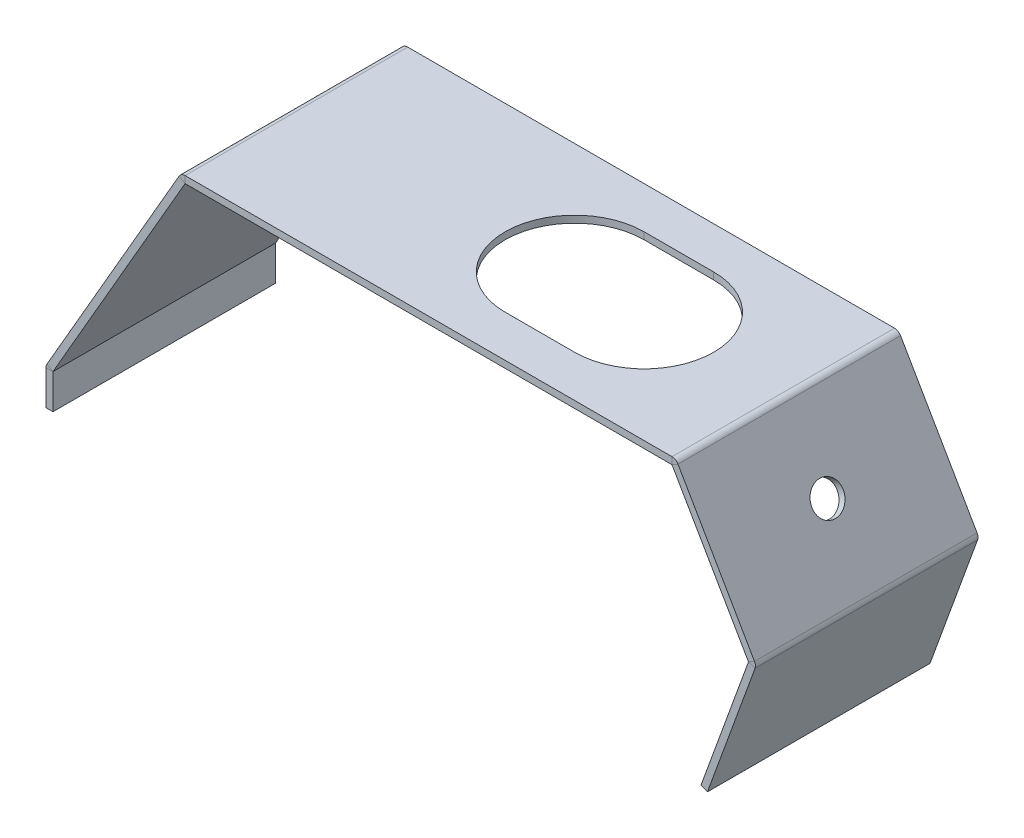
ISO-10303-21;
HEADER;
FILE_DESCRIPTION(('STEP AP214'),'2;1');
FILE_NAME('part.step','',(''),(''),'','','');
FILE_SCHEMA(('AUTOMOTIVE_DESIGN { 1 0 10303 214 1 1 1 1 }'));
ENDSEC;
DATA;
#1=APPLICATION_CONTEXT('core data for automotive mechanical design processes');
#2=APPLICATION_PROTOCOL_DEFINITION('international standard','automotive_design',2000,#1);
#3=PRODUCT_CONTEXT('',#1,'mechanical');
#4=PRODUCT('Part','Part','',(#3));
#5=PRODUCT_RELATED_PRODUCT_CATEGORY('part','',(#4));
#6=PRODUCT_DEFINITION_FORMATION('','',#4);
#7=PRODUCT_DEFINITION_CONTEXT('part definition',#1,'design');
#8=PRODUCT_DEFINITION('design','',#6,#7);
#9=PRODUCT_DEFINITION_SHAPE('','',#8);
#10=(LENGTH_UNIT() NAMED_UNIT(*) SI_UNIT(.MILLI.,.METRE.));
#11=(NAMED_UNIT(*) PLANE_ANGLE_UNIT() SI_UNIT($,.RADIAN.));
#12=(NAMED_UNIT(*) SI_UNIT($,.STERADIAN.) SOLID_ANGLE_UNIT());
#13=UNCERTAINTY_MEASURE_WITH_UNIT(LENGTH_MEASURE(1.E-05),#10,'distance_accuracy_value','');
#14=(GEOMETRIC_REPRESENTATION_CONTEXT(3) GLOBAL_UNCERTAINTY_ASSIGNED_CONTEXT((#13)) GLOBAL_UNIT_ASSIGNED_CONTEXT((#10,
#11,#12)) REPRESENTATION_CONTEXT('',''));
#15=CARTESIAN_POINT('',(0.,0.,0.));
#16=DIRECTION('',(0.,0.,1.));
#17=DIRECTION('',(1.,0.,0.));
#18=AXIS2_PLACEMENT_3D('',#15,#16,#17);
#19=CARTESIAN_POINT('',(20.6339455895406,-36.7390426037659,0.));
#20=DIRECTION('',(0.,0.,-1.));
#21=DIRECTION('',(-0.499999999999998,-0.86602540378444,0.));
#22=AXIS2_PLACEMENT_3D('',#19,#20,#21);
#23=PLANE('',#22);
#24=DIRECTION('',(0.499999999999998,0.86602540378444,0.));
#25=VECTOR('',#24,1.);
#26=CARTESIAN_POINT('',(20.6339455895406,-36.7390426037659,0.));
#27=LINE('',#26,#25);
#28=CARTESIAN_POINT('',(23.1339455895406,-32.4089155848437,0.));
#29=VERTEX_POINT('',#28);
#30=CARTESIAN_POINT('',(42.1338879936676,0.499949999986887,0.));
#31=VERTEX_POINT('',#30);
#32=EDGE_CURVE('E453',#29,#31,#27,.T.);
#33=ORIENTED_EDGE('',*,*,#32,.F.);
#34=DIRECTION('',(0.86602540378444,-0.499999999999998,0.));
#35=VECTOR('',#34,1.);
#36=CARTESIAN_POINT('',(23.1339455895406,-32.4089155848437,0.));
#37=LINE('',#36,#35);
#38=CARTESIAN_POINT('',(23.999970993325,-32.9089155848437,0.));
#39=VERTEX_POINT('',#38);
#40=EDGE_CURVE('E12',#29,#39,#37,.T.);
#41=ORIENTED_EDGE('',*,*,#40,.T.);
#42=DIRECTION('',(0.499999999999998,0.86602540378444,0.));
#43=VECTOR('',#42,1.);
#44=CARTESIAN_POINT('',(21.499970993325,-37.2390426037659,0.));
#45=LINE('',#44,#43);
#46=CARTESIAN_POINT('',(42.9999133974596,-5.00000000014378E-05,0.));
#47=VERTEX_POINT('',#46);
#48=EDGE_CURVE('E343',#39,#47,#45,.T.);
#49=ORIENTED_EDGE('',*,*,#48,.T.);
#50=DIRECTION('',(0.86602540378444,-0.499999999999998,0.));
#51=VECTOR('',#50,1.);
#52=CARTESIAN_POINT('',(42.1338879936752,0.499949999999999,0.));
#53=LINE('',#52,#51);
#54=EDGE_CURVE('E348',#31,#47,#53,.T.);
#55=ORIENTED_EDGE('',*,*,#54,.F.);
#56=EDGE_LOOP('',(#33,#41,#49,#55));
#57=FACE_BOUND('',#56,.T.);
#58=ADVANCED_FACE('F49',(#57),#23,.F.);
#59=CARTESIAN_POINT('',(20.6339455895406,-36.7390426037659,-32.));
#60=DIRECTION('',(0.,0.,1.));
#61=DIRECTION('',(0.499999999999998,0.86602540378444,0.));
#62=AXIS2_PLACEMENT_3D('',#59,#60,#61);
#63=PLANE('',#62);
#64=DIRECTION('',(-0.499999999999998,-0.86602540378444,0.));
#65=VECTOR('',#64,1.);
#66=CARTESIAN_POINT('',(21.499970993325,-37.2390426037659,-32.));
#67=LINE('',#66,#65);
#68=CARTESIAN_POINT('',(42.9999133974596,-5.00000000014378E-05,-32.));
#69=VERTEX_POINT('',#68);
#70=CARTESIAN_POINT('',(23.999970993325,-32.9089155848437,-32.));
#71=VERTEX_POINT('',#70);
#72=EDGE_CURVE('E344',#69,#71,#67,.T.);
#73=ORIENTED_EDGE('',*,*,#72,.T.);
#74=DIRECTION('',(-0.86602540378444,0.499999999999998,0.));
#75=VECTOR('',#74,1.);
#76=CARTESIAN_POINT('',(23.1339455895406,-32.4089155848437,-32.));
#77=LINE('',#76,#75);
#78=CARTESIAN_POINT('',(23.1339455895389,-32.4089155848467,-32.));
#79=VERTEX_POINT('',#78);
#80=EDGE_CURVE('E447',#71,#79,#77,.T.);
#81=ORIENTED_EDGE('',*,*,#80,.T.);
#82=DIRECTION('',(-0.499999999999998,-0.86602540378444,0.));
#83=VECTOR('',#82,1.);
#84=CARTESIAN_POINT('',(20.6339455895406,-36.7390426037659,-32.));
#85=LINE('',#84,#83);
#86=CARTESIAN_POINT('',(42.1338879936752,0.499949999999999,-32.));
#87=VERTEX_POINT('',#86);
#88=EDGE_CURVE('E52',#87,#79,#85,.T.);
#89=ORIENTED_EDGE('',*,*,#88,.F.);
#90=DIRECTION('',(-0.86602540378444,0.499999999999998,0.));
#91=VECTOR('',#90,1.);
#92=CARTESIAN_POINT('',(42.1338879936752,0.499949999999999,-32.));
#93=LINE('',#92,#91);
#94=EDGE_CURVE('E345',#69,#87,#93,.T.);
#95=ORIENTED_EDGE('',*,*,#94,.F.);
#96=EDGE_LOOP('',(#73,#81,#89,#95));
#97=FACE_BOUND('',#96,.T.);
#98=ADVANCED_FACE('F463',(#97),#63,.F.);
#99=CARTESIAN_POINT('',(20.6339455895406,-36.7390426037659,-32.));
#100=DIRECTION('',(0.86602540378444,-0.499999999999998,0.));
#101=DIRECTION('',(0.,0.,-1.));
#102=AXIS2_PLACEMENT_3D('',#99,#100,#101);
#103=PLANE('',#102);
#104=ORIENTED_EDGE('',*,*,#88,.T.);
#105=DIRECTION('',(0.,0.,1.));
#106=VECTOR('',#105,1.);
#107=CARTESIAN_POINT('',(23.1339455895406,-32.4089155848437,-32.));
#108=LINE('',#107,#106);
#109=EDGE_CURVE('E440',#79,#29,#108,.T.);
#110=ORIENTED_EDGE('',*,*,#109,.T.);
#111=ORIENTED_EDGE('',*,*,#32,.T.);
#112=DIRECTION('',(0.,0.,1.));
#113=VECTOR('',#112,1.);
#114=CARTESIAN_POINT('',(42.1338879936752,0.499949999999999,-32.));
#115=LINE('',#114,#113);
#116=EDGE_CURVE('E335',#87,#31,#115,.T.);
#117=ORIENTED_EDGE('',*,*,#116,.F.);
#118=EDGE_LOOP('',(#104,#110,#111,#117));
#119=FACE_BOUND('',#118,.T.);
#120=ADVANCED_FACE('F459',(#119),#103,.F.);
#121=CARTESIAN_POINT('',(56.5000290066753,97.8609203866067,-32.));
#122=DIRECTION('',(-0.86602540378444,-0.499999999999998,0.));
#123=DIRECTION('',(0.,0.,-1.));
#124=AXIS2_PLACEMENT_3D('',#121,#122,#123);
#125=PLANE('',#124);
#126=CARTESIAN_POINT('',(118.500029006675,-9.52622968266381,-16.));
#127=DIRECTION('',(0.86602540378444,0.499999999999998,0.));
#128=DIRECTION('',(0.,0.,1.));
#129=AXIS2_PLACEMENT_3D('',#126,#127,#128);
#130=CIRCLE('',#129,2.25000000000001);
#131=CARTESIAN_POINT('',(118.500029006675,-9.52622968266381,-13.75));
#132=VERTEX_POINT('',#131);
#133=EDGE_CURVE('E312',#132,#132,#130,.T.);
#134=ORIENTED_EDGE('',*,*,#133,.T.);
#135=EDGE_LOOP('',(#134));
#136=FACE_BOUND('',#135,.T.);
#137=DIRECTION('',(-0.499999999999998,0.86602540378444,0.));
#138=VECTOR('',#137,1.);
#139=CARTESIAN_POINT('',(56.5000290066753,97.8609203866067,-32.));
#140=LINE('',#139,#138);
#141=CARTESIAN_POINT('',(124.000029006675,-19.0525091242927,-32.));
#142=VERTEX_POINT('',#141);
#143=CARTESIAN_POINT('',(113.00008660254,-5.00000000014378E-05,-32.));
#144=VERTEX_POINT('',#143);
#145=EDGE_CURVE('E72',#142,#144,#140,.T.);
#146=ORIENTED_EDGE('',*,*,#145,.F.);
#147=DIRECTION('',(0.,0.,1.));
#148=VECTOR('',#147,1.);
#149=CARTESIAN_POINT('',(124.000029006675,-19.0525091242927,-32.));
#150=LINE('',#149,#148);
#151=CARTESIAN_POINT('',(124.000029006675,-19.0525091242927,0.));
#152=VERTEX_POINT('',#151);
#153=EDGE_CURVE('E435',#142,#152,#150,.T.);
#154=ORIENTED_EDGE('',*,*,#153,.T.);
#155=DIRECTION('',(0.499999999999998,-0.86602540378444,0.));
#156=VECTOR('',#155,1.);
#157=CARTESIAN_POINT('',(56.5000290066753,97.8609203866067,0.));
#158=LINE('',#157,#156);
#159=CARTESIAN_POINT('',(113.00008660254,-5.00000000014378E-05,0.));
#160=VERTEX_POINT('',#159);
#161=EDGE_CURVE('E315',#160,#152,#158,.T.);
#162=ORIENTED_EDGE('',*,*,#161,.F.);
#163=DIRECTION('',(0.,0.,1.));
#164=VECTOR('',#163,1.);
#165=CARTESIAN_POINT('',(113.00008660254,-5.00000000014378E-05,-32.));
#166=LINE('',#165,#164);
#167=EDGE_CURVE('E303',#144,#160,#166,.T.);
#168=ORIENTED_EDGE('',*,*,#167,.F.);
#169=EDGE_LOOP('',(#146,#154,#162,#168));
#170=FACE_BOUND('',#169,.T.);
#171=ADVANCED_FACE('F535',(#136,#170),#125,.T.);
#172=CARTESIAN_POINT('',(0.,0.,-32.));
#173=DIRECTION('',(0.,-1.,0.));
#174=DIRECTION('',(0.,0.,-1.));
#175=AXIS2_PLACEMENT_3D('',#172,#173,#174);
#176=PLANE('',#175);
#177=DIRECTION('',(1.,0.,0.));
#178=VECTOR('',#177,1.);
#179=CARTESIAN_POINT('',(93.,0.,-6.00000000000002));
#180=LINE('',#179,#178);
#181=CARTESIAN_POINT('',(83.,0.,-6.00000000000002));
#182=VERTEX_POINT('',#181);
#183=CARTESIAN_POINT('',(93.,0.,-6.00000000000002));
#184=VERTEX_POINT('',#183);
#185=EDGE_CURVE('E369',#182,#184,#180,.T.);
#186=ORIENTED_EDGE('',*,*,#185,.T.);
#187=CARTESIAN_POINT('',(93.,0.,-16.));
#188=DIRECTION('',(0.,1.,0.));
#189=DIRECTION('',(0.,0.,1.));
#190=AXIS2_PLACEMENT_3D('',#187,#188,#189);
#191=CIRCLE('',#190,9.99999999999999);
#192=CARTESIAN_POINT('',(93.,0.,-26.));
#193=VERTEX_POINT('',#192);
#194=EDGE_CURVE('E360',#184,#193,#191,.T.);
#195=ORIENTED_EDGE('',*,*,#194,.T.);
#196=DIRECTION('',(-1.,0.,0.));
#197=VECTOR('',#196,1.);
#198=CARTESIAN_POINT('',(93.,0.,-26.));
#199=LINE('',#198,#197);
#200=CARTESIAN_POINT('',(83.,0.,-26.));
#201=VERTEX_POINT('',#200);
#202=EDGE_CURVE('E379',#193,#201,#199,.T.);
#203=ORIENTED_EDGE('',*,*,#202,.T.);
#204=CARTESIAN_POINT('',(83.,0.,-16.));
#205=DIRECTION('',(0.,1.,0.));
#206=DIRECTION('',(0.,0.,1.));
#207=AXIS2_PLACEMENT_3D('',#204,#205,#206);
#208=CIRCLE('',#207,9.99999999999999);
#209=EDGE_CURVE('E382',#201,#182,#208,.T.);
#210=ORIENTED_EDGE('',*,*,#209,.T.);
#211=EDGE_LOOP('',(#186,#195,#203,#210));
#212=FACE_BOUND('',#211,.T.);
#213=DIRECTION('',(-1.,0.,0.));
#214=VECTOR('',#213,1.);
#215=CARTESIAN_POINT('',(0.,0.,-32.));
#216=LINE('',#215,#214);
#217=CARTESIAN_POINT('',(113.,0.,-32.));
#218=VERTEX_POINT('',#217);
#219=CARTESIAN_POINT('',(43.,0.,-32.));
#220=VERTEX_POINT('',#219);
#221=EDGE_CURVE('E422',#218,#220,#216,.T.);
#222=ORIENTED_EDGE('',*,*,#221,.F.);
#223=DIRECTION('',(0.,0.,1.));
#224=VECTOR('',#223,1.);
#225=CARTESIAN_POINT('',(113.,0.,-32.));
#226=LINE('',#225,#224);
#227=CARTESIAN_POINT('',(113.,0.,0.));
#228=VERTEX_POINT('',#227);
#229=EDGE_CURVE('E415',#218,#228,#226,.T.);
#230=ORIENTED_EDGE('',*,*,#229,.T.);
#231=DIRECTION('',(1.,0.,0.));
#232=VECTOR('',#231,1.);
#233=CARTESIAN_POINT('',(0.,0.,0.));
#234=LINE('',#233,#232);
#235=CARTESIAN_POINT('',(43.,0.,0.));
#236=VERTEX_POINT('',#235);
#237=EDGE_CURVE('E396',#236,#228,#234,.T.);
#238=ORIENTED_EDGE('',*,*,#237,.F.);
#239=DIRECTION('',(0.,0.,1.));
#240=VECTOR('',#239,1.);
#241=CARTESIAN_POINT('',(43.,0.,-32.));
#242=LINE('',#241,#240);
#243=EDGE_CURVE('E404',#220,#236,#242,.T.);
#244=ORIENTED_EDGE('',*,*,#243,.F.);
#245=EDGE_LOOP('',(#222,#230,#238,#244));
#246=FACE_BOUND('',#245,.T.);
#247=ADVANCED_FACE('F544',(#212,#246),#176,.T.);
#248=CARTESIAN_POINT('',(0.,1.,-32.));
#249=DIRECTION('',(0.,0.,1.));
#250=DIRECTION('',(1.,0.,0.));
#251=AXIS2_PLACEMENT_3D('',#248,#249,#250);
#252=PLANE('',#251);
#253=DIRECTION('',(0.,1.,0.));
#254=VECTOR('',#253,1.);
#255=CARTESIAN_POINT('',(113.,1.,-32.));
#256=LINE('',#255,#254);
#257=CARTESIAN_POINT('',(113.,0.999999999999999,-32.));
#258=VERTEX_POINT('',#257);
#259=EDGE_CURVE('E418',#218,#258,#256,.T.);
#260=ORIENTED_EDGE('',*,*,#259,.F.);
#261=ORIENTED_EDGE('',*,*,#221,.T.);
#262=DIRECTION('',(0.,1.,0.));
#263=VECTOR('',#262,1.);
#264=CARTESIAN_POINT('',(43.,1.,-32.));
#265=LINE('',#264,#263);
#266=CARTESIAN_POINT('',(43.,0.999999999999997,-32.));
#267=VERTEX_POINT('',#266);
#268=EDGE_CURVE('E400',#220,#267,#265,.T.);
#269=ORIENTED_EDGE('',*,*,#268,.T.);
#270=DIRECTION('',(-1.,0.,0.));
#271=VECTOR('',#270,1.);
#272=CARTESIAN_POINT('',(0.,1.,-32.));
#273=LINE('',#272,#271);
#274=EDGE_CURVE('E401',#258,#267,#273,.T.);
#275=ORIENTED_EDGE('',*,*,#274,.F.);
#276=EDGE_LOOP('',(#260,#261,#269,#275));
#277=FACE_BOUND('',#276,.T.);
#278=ADVANCED_FACE('F511',(#277),#252,.F.);
#279=CARTESIAN_POINT('',(0.,1.,0.));
#280=DIRECTION('',(0.,0.,-1.));
#281=DIRECTION('',(-1.,0.,0.));
#282=AXIS2_PLACEMENT_3D('',#279,#280,#281);
#283=PLANE('',#282);
#284=DIRECTION('',(0.,-1.,0.));
#285=VECTOR('',#284,1.);
#286=CARTESIAN_POINT('',(113.,1.,0.));
#287=LINE('',#286,#285);
#288=CARTESIAN_POINT('',(113.,1.,0.));
#289=VERTEX_POINT('',#288);
#290=EDGE_CURVE('E412',#289,#228,#287,.T.);
#291=ORIENTED_EDGE('',*,*,#290,.F.);
#292=DIRECTION('',(1.,0.,0.));
#293=VECTOR('',#292,1.);
#294=CARTESIAN_POINT('',(0.,1.,0.));
#295=LINE('',#294,#293);
#296=CARTESIAN_POINT('',(43.,1.,0.));
#297=VERTEX_POINT('',#296);
#298=EDGE_CURVE('E425',#297,#289,#295,.T.);
#299=ORIENTED_EDGE('',*,*,#298,.F.);
#300=DIRECTION('',(0.,-1.,0.));
#301=VECTOR('',#300,1.);
#302=CARTESIAN_POINT('',(43.,1.,0.));
#303=LINE('',#302,#301);
#304=EDGE_CURVE('E406',#297,#236,#303,.T.);
#305=ORIENTED_EDGE('',*,*,#304,.T.);
#306=ORIENTED_EDGE('',*,*,#237,.T.);
#307=EDGE_LOOP('',(#291,#299,#305,#306));
#308=FACE_BOUND('',#307,.T.);
#309=ADVANCED_FACE('F504',(#308),#283,.F.);
#310=CARTESIAN_POINT('',(0.,1.,-32.));
#311=DIRECTION('',(0.,-1.,0.));
#312=DIRECTION('',(0.,0.,-1.));
#313=AXIS2_PLACEMENT_3D('',#310,#311,#312);
#314=PLANE('',#313);
#315=DIRECTION('',(0.,0.,1.));
#316=VECTOR('',#315,1.);
#317=CARTESIAN_POINT('',(113.,1.,-32.));
#318=LINE('',#317,#316);
#319=EDGE_CURVE('E409',#258,#289,#318,.T.);
#320=ORIENTED_EDGE('',*,*,#319,.F.);
#321=ORIENTED_EDGE('',*,*,#274,.T.);
#322=DIRECTION('',(0.,0.,1.));
#323=VECTOR('',#322,1.);
#324=CARTESIAN_POINT('',(43.,1.,-32.));
#325=LINE('',#324,#323);
#326=EDGE_CURVE('E397',#267,#297,#325,.T.);
#327=ORIENTED_EDGE('',*,*,#326,.T.);
#328=ORIENTED_EDGE('',*,*,#298,.T.);
#329=EDGE_LOOP('',(#320,#321,#327,#328));
#330=FACE_BOUND('',#329,.T.);
#331=CARTESIAN_POINT('',(93.,1.,-16.));
#332=DIRECTION('',(0.,1.,0.));
#333=DIRECTION('',(0.,0.,1.));
#334=AXIS2_PLACEMENT_3D('',#331,#332,#333);
#335=CIRCLE('',#334,9.99999999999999);
#336=CARTESIAN_POINT('',(93.,1.,-6.00000000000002));
#337=VERTEX_POINT('',#336);
#338=CARTESIAN_POINT('',(93.,1.,-26.));
#339=VERTEX_POINT('',#338);
#340=EDGE_CURVE('E366',#337,#339,#335,.T.);
#341=ORIENTED_EDGE('',*,*,#340,.F.);
#342=DIRECTION('',(1.,0.,0.));
#343=VECTOR('',#342,1.);
#344=CARTESIAN_POINT('',(93.,1.,-6.00000000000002));
#345=LINE('',#344,#343);
#346=CARTESIAN_POINT('',(83.,1.,-6.00000000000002));
#347=VERTEX_POINT('',#346);
#348=EDGE_CURVE('E374',#347,#337,#345,.T.);
#349=ORIENTED_EDGE('',*,*,#348,.F.);
#350=CARTESIAN_POINT('',(83.,1.,-16.));
#351=DIRECTION('',(0.,1.,0.));
#352=DIRECTION('',(0.,0.,1.));
#353=AXIS2_PLACEMENT_3D('',#350,#351,#352);
#354=CIRCLE('',#353,9.99999999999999);
#355=CARTESIAN_POINT('',(83.,1.,-26.));
#356=VERTEX_POINT('',#355);
#357=EDGE_CURVE('E371',#356,#347,#354,.T.);
#358=ORIENTED_EDGE('',*,*,#357,.F.);
#359=DIRECTION('',(-1.,0.,0.));
#360=VECTOR('',#359,1.);
#361=CARTESIAN_POINT('',(93.,1.,-26.));
#362=LINE('',#361,#360);
#363=EDGE_CURVE('E368',#339,#356,#362,.T.);
#364=ORIENTED_EDGE('',*,*,#363,.F.);
#365=EDGE_LOOP('',(#341,#349,#358,#364));
#366=FACE_BOUND('',#365,.T.);
#367=ADVANCED_FACE('F507',(#330,#366),#314,.F.);
#368=CARTESIAN_POINT('',(93.,1.,-16.));
#369=DIRECTION('',(0.,-1.,0.));
#370=DIRECTION('',(0.,0.,-1.));
#371=AXIS2_PLACEMENT_3D('',#368,#369,#370);
#372=CYLINDRICAL_SURFACE('',#371,9.99999999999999);
#373=ORIENTED_EDGE('',*,*,#194,.F.);
#374=DIRECTION('',(0.,-1.,0.));
#375=VECTOR('',#374,1.);
#376=CARTESIAN_POINT('',(93.,1.,-6.00000000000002));
#377=LINE('',#376,#375);
#378=EDGE_CURVE('E376',#337,#184,#377,.T.);
#379=ORIENTED_EDGE('',*,*,#378,.F.);
#380=ORIENTED_EDGE('',*,*,#340,.T.);
#381=DIRECTION('',(0.,-1.,0.));
#382=VECTOR('',#381,1.);
#383=CARTESIAN_POINT('',(93.,1.,-26.));
#384=LINE('',#383,#382);
#385=EDGE_CURVE('E393',#339,#193,#384,.T.);
#386=ORIENTED_EDGE('',*,*,#385,.T.);
#387=EDGE_LOOP('',(#373,#379,#380,#386));
#388=FACE_BOUND('',#387,.T.);
#389=ADVANCED_FACE('F563',(#388),#372,.F.);
#390=CARTESIAN_POINT('',(93.,1.,-26.));
#391=DIRECTION('',(0.,0.,1.));
#392=DIRECTION('',(1.,0.,0.));
#393=AXIS2_PLACEMENT_3D('',#390,#391,#392);
#394=PLANE('',#393);
#395=ORIENTED_EDGE('',*,*,#202,.F.);
#396=ORIENTED_EDGE('',*,*,#385,.F.);
#397=ORIENTED_EDGE('',*,*,#363,.T.);
#398=DIRECTION('',(0.,-1.,0.));
#399=VECTOR('',#398,1.);
#400=CARTESIAN_POINT('',(83.,1.,-26.));
#401=LINE('',#400,#399);
#402=EDGE_CURVE('E391',#356,#201,#401,.T.);
#403=ORIENTED_EDGE('',*,*,#402,.T.);
#404=EDGE_LOOP('',(#395,#396,#397,#403));
#405=FACE_BOUND('',#404,.T.);
#406=ADVANCED_FACE('F566',(#405),#394,.T.);
#407=CARTESIAN_POINT('',(83.,1.,-16.));
#408=DIRECTION('',(0.,-1.,0.));
#409=DIRECTION('',(0.,0.,-1.));
#410=AXIS2_PLACEMENT_3D('',#407,#408,#409);
#411=CYLINDRICAL_SURFACE('',#410,9.99999999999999);
#412=ORIENTED_EDGE('',*,*,#209,.F.);
#413=ORIENTED_EDGE('',*,*,#402,.F.);
#414=ORIENTED_EDGE('',*,*,#357,.T.);
#415=DIRECTION('',(0.,-1.,0.));
#416=VECTOR('',#415,1.);
#417=CARTESIAN_POINT('',(83.,1.,-6.00000000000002));
#418=LINE('',#417,#416);
#419=EDGE_CURVE('E389',#347,#182,#418,.T.);
#420=ORIENTED_EDGE('',*,*,#419,.T.);
#421=EDGE_LOOP('',(#412,#413,#414,#420));
#422=FACE_BOUND('',#421,.T.);
#423=ADVANCED_FACE('F570',(#422),#411,.F.);
#424=CARTESIAN_POINT('',(93.,1.,-6.00000000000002));
#425=DIRECTION('',(0.,0.,-1.));
#426=DIRECTION('',(-1.,0.,0.));
#427=AXIS2_PLACEMENT_3D('',#424,#425,#426);
#428=PLANE('',#427);
#429=ORIENTED_EDGE('',*,*,#185,.F.);
#430=ORIENTED_EDGE('',*,*,#419,.F.);
#431=ORIENTED_EDGE('',*,*,#348,.T.);
#432=ORIENTED_EDGE('',*,*,#378,.T.);
#433=EDGE_LOOP('',(#429,#430,#431,#432));
#434=FACE_BOUND('',#433,.T.);
#435=ADVANCED_FACE('F574',(#434),#428,.T.);
#436=CARTESIAN_POINT('',(43.,-0.000100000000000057,-32.));
#437=DIRECTION('',(0.,0.,-1.));
#438=DIRECTION('',(-1.,0.,0.));
#439=AXIS2_PLACEMENT_3D('',#436,#437,#438);
#440=PLANE('',#439);
#441=ORIENTED_EDGE('',*,*,#268,.F.);
#442=CARTESIAN_POINT('',(43.,-0.000100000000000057,-32.));
#443=DIRECTION('',(0.,0.,1.));
#444=DIRECTION('',(1.,0.,0.));
#445=AXIS2_PLACEMENT_3D('',#442,#443,#444);
#446=CIRCLE('',#445,0.000100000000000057);
#447=EDGE_CURVE('E363',#220,#69,#446,.T.);
#448=ORIENTED_EDGE('',*,*,#447,.T.);
#449=ORIENTED_EDGE('',*,*,#94,.T.);
#450=CARTESIAN_POINT('',(43.,-0.000100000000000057,-32.));
#451=DIRECTION('',(0.,0.,1.));
#452=DIRECTION('',(1.,0.,0.));
#453=AXIS2_PLACEMENT_3D('',#450,#451,#452);
#454=CIRCLE('',#453,1.0001);
#455=EDGE_CURVE('E353',#267,#87,#454,.T.);
#456=ORIENTED_EDGE('',*,*,#455,.F.);
#457=EDGE_LOOP('',(#441,#448,#449,#456));
#458=FACE_BOUND('',#457,.T.);
#459=ADVANCED_FACE('F515',(#458),#440,.T.);
#460=CARTESIAN_POINT('',(43.,-0.000100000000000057,0.));
#461=DIRECTION('',(0.,0.,1.));
#462=DIRECTION('',(1.,0.,0.));
#463=AXIS2_PLACEMENT_3D('',#460,#461,#462);
#464=PLANE('',#463);
#465=ORIENTED_EDGE('',*,*,#54,.T.);
#466=CARTESIAN_POINT('',(43.,-0.000100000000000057,0.));
#467=DIRECTION('',(0.,0.,1.));
#468=DIRECTION('',(1.,0.,0.));
#469=AXIS2_PLACEMENT_3D('',#466,#467,#468);
#470=CIRCLE('',#469,0.000100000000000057);
#471=EDGE_CURVE('E357',#47,#236,#470,.F.);
#472=ORIENTED_EDGE('',*,*,#471,.T.);
#473=ORIENTED_EDGE('',*,*,#304,.F.);
#474=CARTESIAN_POINT('',(43.,-0.000100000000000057,0.));
#475=DIRECTION('',(0.,0.,-1.));
#476=DIRECTION('',(-1.,0.,0.));
#477=AXIS2_PLACEMENT_3D('',#474,#475,#476);
#478=CIRCLE('',#477,1.0001);
#479=EDGE_CURVE('E356',#31,#297,#478,.T.);
#480=ORIENTED_EDGE('',*,*,#479,.F.);
#481=EDGE_LOOP('',(#465,#472,#473,#480));
#482=FACE_BOUND('',#481,.T.);
#483=ADVANCED_FACE('F499',(#482),#464,.T.);
#484=CARTESIAN_POINT('',(43.,-0.000100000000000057,-48.0156211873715));
#485=DIRECTION('',(0.,0.,1.));
#486=DIRECTION('',(1.,0.,0.));
#487=AXIS2_PLACEMENT_3D('',#484,#485,#486);
#488=CYLINDRICAL_SURFACE('',#487,1.0001);
#489=ORIENTED_EDGE('',*,*,#479,.T.);
#490=ORIENTED_EDGE('',*,*,#326,.F.);
#491=ORIENTED_EDGE('',*,*,#455,.T.);
#492=ORIENTED_EDGE('',*,*,#116,.T.);
#493=EDGE_LOOP('',(#489,#490,#491,#492));
#494=FACE_BOUND('',#493,.T.);
#495=ADVANCED_FACE('F497',(#494),#488,.T.);
#496=CARTESIAN_POINT('',(43.,-0.000100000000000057,-48.0156211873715));
#497=DIRECTION('',(0.,0.,1.));
#498=DIRECTION('',(1.,0.,0.));
#499=AXIS2_PLACEMENT_3D('',#496,#497,#498);
#500=CYLINDRICAL_SURFACE('',#499,0.000100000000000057);
#501=ORIENTED_EDGE('',*,*,#471,.F.);
#502=DIRECTION('',(0.,0.,1.));
#503=VECTOR('',#502,1.);
#504=CARTESIAN_POINT('',(42.9999133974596,-5.00000000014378E-05,-32.));
#505=LINE('',#504,#503);
#506=EDGE_CURVE('E340',#69,#47,#505,.T.);
#507=ORIENTED_EDGE('',*,*,#506,.F.);
#508=ORIENTED_EDGE('',*,*,#447,.F.);
#509=ORIENTED_EDGE('',*,*,#243,.T.);
#510=EDGE_LOOP('',(#501,#507,#508,#509));
#511=FACE_BOUND('',#510,.T.);
#512=ADVANCED_FACE('F518',(#511),#500,.F.);
#513=CARTESIAN_POINT('',(21.499970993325,-37.2390426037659,-32.));
#514=DIRECTION('',(0.86602540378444,-0.499999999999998,0.));
#515=DIRECTION('',(0.,0.,-1.));
#516=AXIS2_PLACEMENT_3D('',#513,#514,#515);
#517=PLANE('',#516);
#518=DIRECTION('',(0.,0.,1.));
#519=VECTOR('',#518,1.);
#520=CARTESIAN_POINT('',(23.999970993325,-32.9089155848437,-32.));
#521=LINE('',#520,#519);
#522=EDGE_CURVE('E57',#71,#39,#521,.T.);
#523=ORIENTED_EDGE('',*,*,#522,.F.);
#524=ORIENTED_EDGE('',*,*,#72,.F.);
#525=ORIENTED_EDGE('',*,*,#506,.T.);
#526=ORIENTED_EDGE('',*,*,#48,.F.);
#527=EDGE_LOOP('',(#523,#524,#525,#526));
#528=FACE_BOUND('',#527,.T.);
#529=ADVANCED_FACE('F520',(#528),#517,.T.);
#530=CARTESIAN_POINT('',(113.,-0.000100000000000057,-32.));
#531=DIRECTION('',(0.,0.,-1.));
#532=DIRECTION('',(-1.,0.,0.));
#533=AXIS2_PLACEMENT_3D('',#530,#531,#532);
#534=PLANE('',#533);
#535=DIRECTION('',(0.86602540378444,0.499999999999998,0.));
#536=VECTOR('',#535,1.);
#537=CARTESIAN_POINT('',(113.866112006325,0.499949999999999,-32.));
#538=LINE('',#537,#536);
#539=CARTESIAN_POINT('',(113.866112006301,0.499950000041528,-32.));
#540=VERTEX_POINT('',#539);
#541=EDGE_CURVE('E308',#144,#540,#538,.T.);
#542=ORIENTED_EDGE('',*,*,#541,.F.);
#543=CARTESIAN_POINT('',(113.,-0.000100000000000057,-32.));
#544=DIRECTION('',(0.,0.,-1.));
#545=DIRECTION('',(-1.,0.,0.));
#546=AXIS2_PLACEMENT_3D('',#543,#544,#545);
#547=CIRCLE('',#546,0.000100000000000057);
#548=EDGE_CURVE('E311',#144,#218,#547,.F.);
#549=ORIENTED_EDGE('',*,*,#548,.T.);
#550=ORIENTED_EDGE('',*,*,#259,.T.);
#551=CARTESIAN_POINT('',(113.,-0.000100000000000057,-32.));
#552=DIRECTION('',(0.,0.,1.));
#553=DIRECTION('',(1.,0.,0.));
#554=AXIS2_PLACEMENT_3D('',#551,#552,#553);
#555=CIRCLE('',#554,1.0001);
#556=EDGE_CURVE('E328',#540,#258,#555,.T.);
#557=ORIENTED_EDGE('',*,*,#556,.F.);
#558=EDGE_LOOP('',(#542,#549,#550,#557));
#559=FACE_BOUND('',#558,.T.);
#560=ADVANCED_FACE('F522',(#559),#534,.T.);
#561=CARTESIAN_POINT('',(113.,-0.000100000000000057,0.));
#562=DIRECTION('',(0.,0.,1.));
#563=DIRECTION('',(1.,0.,0.));
#564=AXIS2_PLACEMENT_3D('',#561,#562,#563);
#565=PLANE('',#564);
#566=CARTESIAN_POINT('',(113.,-0.000100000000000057,0.));
#567=DIRECTION('',(0.,0.,-1.));
#568=DIRECTION('',(-1.,0.,0.));
#569=AXIS2_PLACEMENT_3D('',#566,#567,#568);
#570=CIRCLE('',#569,0.000100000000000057);
#571=EDGE_CURVE('E332',#228,#160,#570,.T.);
#572=ORIENTED_EDGE('',*,*,#571,.T.);
#573=DIRECTION('',(-0.86602540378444,-0.499999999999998,0.));
#574=VECTOR('',#573,1.);
#575=CARTESIAN_POINT('',(113.866112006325,0.499949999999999,0.));
#576=LINE('',#575,#574);
#577=CARTESIAN_POINT('',(113.866112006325,0.499949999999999,0.));
#578=VERTEX_POINT('',#577);
#579=EDGE_CURVE('E316',#578,#160,#576,.T.);
#580=ORIENTED_EDGE('',*,*,#579,.F.);
#581=CARTESIAN_POINT('',(113.,-0.000100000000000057,0.));
#582=DIRECTION('',(0.,0.,-1.));
#583=DIRECTION('',(-1.,0.,0.));
#584=AXIS2_PLACEMENT_3D('',#581,#582,#583);
#585=CIRCLE('',#584,1.0001);
#586=EDGE_CURVE('E331',#289,#578,#585,.T.);
#587=ORIENTED_EDGE('',*,*,#586,.F.);
#588=ORIENTED_EDGE('',*,*,#290,.T.);
#589=EDGE_LOOP('',(#572,#580,#587,#588));
#590=FACE_BOUND('',#589,.T.);
#591=ADVANCED_FACE('F527',(#590),#565,.T.);
#592=CARTESIAN_POINT('',(113.,-0.000100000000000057,16.0156211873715));
#593=DIRECTION('',(0.,0.,-1.));
#594=DIRECTION('',(-1.,0.,0.));
#595=AXIS2_PLACEMENT_3D('',#592,#593,#594);
#596=CYLINDRICAL_SURFACE('',#595,1.0001);
#597=ORIENTED_EDGE('',*,*,#319,.T.);
#598=ORIENTED_EDGE('',*,*,#586,.T.);
#599=DIRECTION('',(0.,0.,1.));
#600=VECTOR('',#599,1.);
#601=CARTESIAN_POINT('',(113.866112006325,0.499949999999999,-32.));
#602=LINE('',#601,#600);
#603=EDGE_CURVE('E320',#540,#578,#602,.T.);
#604=ORIENTED_EDGE('',*,*,#603,.F.);
#605=ORIENTED_EDGE('',*,*,#556,.T.);
#606=EDGE_LOOP('',(#597,#598,#604,#605));
#607=FACE_BOUND('',#606,.T.);
#608=ADVANCED_FACE('F530',(#607),#596,.T.);
#609=CARTESIAN_POINT('',(113.,-0.000100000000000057,16.0156211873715));
#610=DIRECTION('',(0.,0.,-1.));
#611=DIRECTION('',(-1.,0.,0.));
#612=AXIS2_PLACEMENT_3D('',#609,#610,#611);
#613=CYLINDRICAL_SURFACE('',#612,0.000100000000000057);
#614=ORIENTED_EDGE('',*,*,#229,.F.);
#615=ORIENTED_EDGE('',*,*,#548,.F.);
#616=ORIENTED_EDGE('',*,*,#167,.T.);
#617=ORIENTED_EDGE('',*,*,#571,.F.);
#618=EDGE_LOOP('',(#614,#615,#616,#617));
#619=FACE_BOUND('',#618,.T.);
#620=ADVANCED_FACE('F587',(#619),#613,.F.);
#621=CARTESIAN_POINT('',(119.366054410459,-9.02622968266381,-16.));
#622=DIRECTION('',(-0.86602540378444,-0.499999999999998,0.));
#623=DIRECTION('',(0.,0.,-1.));
#624=AXIS2_PLACEMENT_3D('',#621,#622,#623);
#625=CYLINDRICAL_SURFACE('',#624,2.25000000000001);
#626=CARTESIAN_POINT('',(119.366054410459,-9.02622968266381,-16.));
#627=DIRECTION('',(0.86602540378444,0.499999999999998,0.));
#628=DIRECTION('',(0.,0.,1.));
#629=AXIS2_PLACEMENT_3D('',#626,#627,#628);
#630=CIRCLE('',#629,2.25000000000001);
#631=CARTESIAN_POINT('',(119.366054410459,-9.02622968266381,-13.75));
#632=VERTEX_POINT('',#631);
#633=EDGE_CURVE('E323',#632,#632,#630,.T.);
#634=ORIENTED_EDGE('',*,*,#633,.T.);
#635=EDGE_LOOP('',(#634));
#636=FACE_BOUND('',#635,.T.);
#637=ORIENTED_EDGE('',*,*,#133,.F.);
#638=EDGE_LOOP('',(#637));
#639=FACE_BOUND('',#638,.T.);
#640=ADVANCED_FACE('F552',(#636,#639),#625,.F.);
#641=CARTESIAN_POINT('',(57.3660544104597,98.3609203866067,-32.));
#642=DIRECTION('',(-0.86602540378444,-0.499999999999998,0.));
#643=DIRECTION('',(0.,0.,-1.));
#644=AXIS2_PLACEMENT_3D('',#641,#642,#643);
#645=PLANE('',#644);
#646=DIRECTION('',(0.,0.,1.));
#647=VECTOR('',#646,1.);
#648=CARTESIAN_POINT('',(124.866054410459,-18.5525091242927,-32.));
#649=LINE('',#648,#647);
#650=CARTESIAN_POINT('',(124.866054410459,-18.5525091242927,-32.));
#651=VERTEX_POINT('',#650);
#652=CARTESIAN_POINT('',(124.866054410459,-18.5525091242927,0.));
#653=VERTEX_POINT('',#652);
#654=EDGE_CURVE('E421',#651,#653,#649,.T.);
#655=ORIENTED_EDGE('',*,*,#654,.F.);
#656=DIRECTION('',(-0.499999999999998,0.86602540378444,0.));
#657=VECTOR('',#656,1.);
#658=CARTESIAN_POINT('',(57.3660544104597,98.3609203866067,-32.));
#659=LINE('',#658,#657);
#660=EDGE_CURVE('E322',#651,#540,#659,.T.);
#661=ORIENTED_EDGE('',*,*,#660,.T.);
#662=ORIENTED_EDGE('',*,*,#603,.T.);
#663=DIRECTION('',(0.499999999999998,-0.86602540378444,0.));
#664=VECTOR('',#663,1.);
#665=CARTESIAN_POINT('',(57.3660544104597,98.3609203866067,0.));
#666=LINE('',#665,#664);
#667=EDGE_CURVE('E319',#578,#653,#666,.T.);
#668=ORIENTED_EDGE('',*,*,#667,.T.);
#669=EDGE_LOOP('',(#655,#661,#662,#668));
#670=FACE_BOUND('',#669,.T.);
#671=ORIENTED_EDGE('',*,*,#633,.F.);
#672=EDGE_LOOP('',(#671));
#673=FACE_BOUND('',#672,.T.);
#674=ADVANCED_FACE('F548',(#670,#673),#645,.F.);
#675=CARTESIAN_POINT('',(57.3660544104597,98.3609203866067,0.));
#676=DIRECTION('',(0.,0.,-1.));
#677=DIRECTION('',(-0.499999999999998,0.86602540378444,0.));
#678=AXIS2_PLACEMENT_3D('',#675,#676,#677);
#679=PLANE('',#678);
#680=DIRECTION('',(-0.86602540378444,-0.499999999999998,0.));
#681=VECTOR('',#680,1.);
#682=CARTESIAN_POINT('',(124.866054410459,-18.5525091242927,0.));
#683=LINE('',#682,#681);
#684=EDGE_CURVE('E432',#653,#152,#683,.T.);
#685=ORIENTED_EDGE('',*,*,#684,.F.);
#686=ORIENTED_EDGE('',*,*,#667,.F.);
#687=ORIENTED_EDGE('',*,*,#579,.T.);
#688=ORIENTED_EDGE('',*,*,#161,.T.);
#689=EDGE_LOOP('',(#685,#686,#687,#688));
#690=FACE_BOUND('',#689,.T.);
#691=ADVANCED_FACE('F540',(#690),#679,.F.);
#692=CARTESIAN_POINT('',(57.3660544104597,98.3609203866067,-32.));
#693=DIRECTION('',(0.,0.,1.));
#694=DIRECTION('',(0.499999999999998,-0.86602540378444,0.));
#695=AXIS2_PLACEMENT_3D('',#692,#693,#694);
#696=PLANE('',#695);
#697=DIRECTION('',(0.86602540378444,0.499999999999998,0.));
#698=VECTOR('',#697,1.);
#699=CARTESIAN_POINT('',(124.866054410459,-18.5525091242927,-32.));
#700=LINE('',#699,#698);
#701=EDGE_CURVE('E437',#142,#651,#700,.T.);
#702=ORIENTED_EDGE('',*,*,#701,.F.);
#703=ORIENTED_EDGE('',*,*,#145,.T.);
#704=ORIENTED_EDGE('',*,*,#541,.T.);
#705=ORIENTED_EDGE('',*,*,#660,.F.);
#706=EDGE_LOOP('',(#702,#703,#704,#705));
#707=FACE_BOUND('',#706,.T.);
#708=ADVANCED_FACE('F536',(#707),#696,.F.);
#709=CARTESIAN_POINT('',(123.999162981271,-19.0530091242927,-32.));
#710=DIRECTION('',(0.,0.,-1.));
#711=DIRECTION('',(-1.,0.,0.));
#712=AXIS2_PLACEMENT_3D('',#709,#710,#711);
#713=PLANE('',#712);
#714=DIRECTION('',(0.939692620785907,-0.342020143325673,0.));
#715=VECTOR('',#714,1.);
#716=CARTESIAN_POINT('',(124.939795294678,-19.3953712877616,-32.));
#717=LINE('',#716,#715);
#718=CARTESIAN_POINT('',(124.000102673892,-19.053351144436,-32.));
#719=VERTEX_POINT('',#718);
#720=CARTESIAN_POINT('',(124.939795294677,-19.3953712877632,-32.));
#721=VERTEX_POINT('',#720);
#722=EDGE_CURVE('E271',#719,#721,#717,.T.);
#723=ORIENTED_EDGE('',*,*,#722,.F.);
#724=CARTESIAN_POINT('',(123.999162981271,-19.0530091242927,-32.));
#725=DIRECTION('',(0.,0.,-1.));
#726=DIRECTION('',(-1.,0.,0.));
#727=AXIS2_PLACEMENT_3D('',#724,#725,#726);
#728=CIRCLE('',#727,0.000999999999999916);
#729=EDGE_CURVE('E270',#719,#142,#728,.F.);
#730=ORIENTED_EDGE('',*,*,#729,.T.);
#731=ORIENTED_EDGE('',*,*,#701,.T.);
#732=CARTESIAN_POINT('',(123.999162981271,-19.0530091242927,-32.));
#733=DIRECTION('',(0.,0.,1.));
#734=DIRECTION('',(1.,0.,0.));
#735=AXIS2_PLACEMENT_3D('',#732,#733,#734);
#736=CIRCLE('',#735,1.001);
#737=EDGE_CURVE('E296',#721,#651,#736,.T.);
#738=ORIENTED_EDGE('',*,*,#737,.F.);
#739=EDGE_LOOP('',(#723,#730,#731,#738));
#740=FACE_BOUND('',#739,.T.);
#741=ADVANCED_FACE('F539',(#740),#713,.T.);
#742=CARTESIAN_POINT('',(123.999162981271,-19.0530091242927,0.));
#743=DIRECTION('',(0.,0.,1.));
#744=DIRECTION('',(1.,0.,0.));
#745=AXIS2_PLACEMENT_3D('',#742,#743,#744);
#746=PLANE('',#745);
#747=CARTESIAN_POINT('',(123.999162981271,-19.0530091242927,0.));
#748=DIRECTION('',(0.,0.,-1.));
#749=DIRECTION('',(-1.,0.,0.));
#750=AXIS2_PLACEMENT_3D('',#747,#748,#749);
#751=CIRCLE('',#750,0.000999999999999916);
#752=CARTESIAN_POINT('',(124.000102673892,-19.053351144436,0.));
#753=VERTEX_POINT('',#752);
#754=EDGE_CURVE('E300',#152,#753,#751,.T.);
#755=ORIENTED_EDGE('',*,*,#754,.T.);
#756=DIRECTION('',(-0.939692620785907,0.342020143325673,0.));
#757=VECTOR('',#756,1.);
#758=CARTESIAN_POINT('',(124.939795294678,-19.3953712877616,0.));
#759=LINE('',#758,#757);
#760=CARTESIAN_POINT('',(124.939795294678,-19.3953712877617,0.));
#761=VERTEX_POINT('',#760);
#762=EDGE_CURVE('E277',#761,#753,#759,.T.);
#763=ORIENTED_EDGE('',*,*,#762,.F.);
#764=CARTESIAN_POINT('',(123.999162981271,-19.0530091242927,0.));
#765=DIRECTION('',(0.,0.,-1.));
#766=DIRECTION('',(-1.,0.,0.));
#767=AXIS2_PLACEMENT_3D('',#764,#765,#766);
#768=CIRCLE('',#767,1.001);
#769=EDGE_CURVE('E299',#653,#761,#768,.T.);
#770=ORIENTED_EDGE('',*,*,#769,.F.);
#771=ORIENTED_EDGE('',*,*,#684,.T.);
#772=EDGE_LOOP('',(#755,#763,#770,#771));
#773=FACE_BOUND('',#772,.T.);
#774=ADVANCED_FACE('F598',(#773),#746,.T.);
#775=CARTESIAN_POINT('',(123.999162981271,-19.0530091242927,16.0156450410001));
#776=DIRECTION('',(0.,0.,-1.));
#777=DIRECTION('',(-1.,0.,0.));
#778=AXIS2_PLACEMENT_3D('',#775,#776,#777);
#779=CYLINDRICAL_SURFACE('',#778,1.001);
#780=ORIENTED_EDGE('',*,*,#654,.T.);
#781=ORIENTED_EDGE('',*,*,#769,.T.);
#782=DIRECTION('',(0.,0.,1.));
#783=VECTOR('',#782,1.);
#784=CARTESIAN_POINT('',(124.939795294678,-19.3953712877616,-32.));
#785=LINE('',#784,#783);
#786=EDGE_CURVE('E284',#721,#761,#785,.T.);
#787=ORIENTED_EDGE('',*,*,#786,.F.);
#788=ORIENTED_EDGE('',*,*,#737,.T.);
#789=EDGE_LOOP('',(#780,#781,#787,#788));
#790=FACE_BOUND('',#789,.T.);
#791=ADVANCED_FACE('F601',(#790),#779,.T.);
#792=CARTESIAN_POINT('',(123.999162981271,-19.0530091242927,16.0156450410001));
#793=DIRECTION('',(0.,0.,-1.));
#794=DIRECTION('',(-1.,0.,0.));
#795=AXIS2_PLACEMENT_3D('',#792,#793,#794);
#796=CYLINDRICAL_SURFACE('',#795,0.000999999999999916);
#797=ORIENTED_EDGE('',*,*,#153,.F.);
#798=ORIENTED_EDGE('',*,*,#729,.F.);
#799=DIRECTION('',(0.,0.,1.));
#800=VECTOR('',#799,1.);
#801=CARTESIAN_POINT('',(124.000102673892,-19.053351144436,-32.));
#802=LINE('',#801,#800);
#803=EDGE_CURVE('E263',#719,#753,#802,.T.);
#804=ORIENTED_EDGE('',*,*,#803,.T.);
#805=ORIENTED_EDGE('',*,*,#754,.F.);
#806=EDGE_LOOP('',(#797,#798,#804,#805));
#807=FACE_BOUND('',#806,.T.);
#808=ADVANCED_FACE('F603',(#807),#796,.F.);
#809=CARTESIAN_POINT('',(118.099693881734,-38.1883954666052,0.));
#810=DIRECTION('',(0.342020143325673,0.939692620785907,0.));
#811=DIRECTION('',(0.,0.,1.));
#812=AXIS2_PLACEMENT_3D('',#809,#810,#811);
#813=PLANE('',#812);
#814=DIRECTION('',(0.,0.,-1.));
#815=VECTOR('',#814,1.);
#816=CARTESIAN_POINT('',(117.160001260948,-37.8463753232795,0.));
#817=LINE('',#816,#815);
#818=CARTESIAN_POINT('',(117.160001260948,-37.8463753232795,0.));
#819=VERTEX_POINT('',#818);
#820=CARTESIAN_POINT('',(117.160001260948,-37.8463753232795,-32.));
#821=VERTEX_POINT('',#820);
#822=EDGE_CURVE('E292',#819,#821,#817,.T.);
#823=ORIENTED_EDGE('',*,*,#822,.T.);
#824=DIRECTION('',(-0.939692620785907,0.342020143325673,0.));
#825=VECTOR('',#824,1.);
#826=CARTESIAN_POINT('',(118.099693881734,-38.1883954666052,-32.));
#827=LINE('',#826,#825);
#828=CARTESIAN_POINT('',(118.099693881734,-38.1883954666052,-32.));
#829=VERTEX_POINT('',#828);
#830=EDGE_CURVE('E267',#829,#821,#827,.T.);
#831=ORIENTED_EDGE('',*,*,#830,.F.);
#832=DIRECTION('',(0.,0.,-1.));
#833=VECTOR('',#832,1.);
#834=CARTESIAN_POINT('',(118.099693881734,-38.1883954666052,0.));
#835=LINE('',#834,#833);
#836=CARTESIAN_POINT('',(118.099693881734,-38.1883954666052,0.));
#837=VERTEX_POINT('',#836);
#838=EDGE_CURVE('E280',#837,#829,#835,.T.);
#839=ORIENTED_EDGE('',*,*,#838,.F.);
#840=DIRECTION('',(-0.939692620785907,0.342020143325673,0.));
#841=VECTOR('',#840,1.);
#842=CARTESIAN_POINT('',(118.099693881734,-38.1883954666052,0.));
#843=LINE('',#842,#841);
#844=EDGE_CURVE('E289',#837,#819,#843,.T.);
#845=ORIENTED_EDGE('',*,*,#844,.T.);
#846=EDGE_LOOP('',(#823,#831,#839,#845));
#847=FACE_BOUND('',#846,.T.);
#848=ADVANCED_FACE('F609',(#847),#813,.F.);
#849=CARTESIAN_POINT('',(171.112816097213,107.46396075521,-32.));
#850=DIRECTION('',(-0.939692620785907,0.342020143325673,0.));
#851=DIRECTION('',(0.,0.,-1.));
#852=AXIS2_PLACEMENT_3D('',#849,#850,#851);
#853=PLANE('',#852);
#854=DIRECTION('',(0.342020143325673,0.939692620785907,0.));
#855=VECTOR('',#854,1.);
#856=CARTESIAN_POINT('',(171.112816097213,107.46396075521,-32.));
#857=LINE('',#856,#855);
#858=EDGE_CURVE('E286',#829,#721,#857,.T.);
#859=ORIENTED_EDGE('',*,*,#858,.T.);
#860=ORIENTED_EDGE('',*,*,#786,.T.);
#861=DIRECTION('',(-0.342020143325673,-0.939692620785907,0.));
#862=VECTOR('',#861,1.);
#863=CARTESIAN_POINT('',(171.112816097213,107.46396075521,0.));
#864=LINE('',#863,#862);
#865=EDGE_CURVE('E282',#761,#837,#864,.T.);
#866=ORIENTED_EDGE('',*,*,#865,.T.);
#867=ORIENTED_EDGE('',*,*,#838,.T.);
#868=EDGE_LOOP('',(#859,#860,#866,#867));
#869=FACE_BOUND('',#868,.T.);
#870=ADVANCED_FACE('F625',(#869),#853,.F.);
#871=CARTESIAN_POINT('',(171.112816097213,107.46396075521,0.));
#872=DIRECTION('',(0.,0.,-1.));
#873=DIRECTION('',(0.342020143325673,0.939692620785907,0.));
#874=AXIS2_PLACEMENT_3D('',#871,#872,#873);
#875=PLANE('',#874);
#876=ORIENTED_EDGE('',*,*,#865,.F.);
#877=ORIENTED_EDGE('',*,*,#762,.T.);
#878=DIRECTION('',(-0.342020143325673,-0.939692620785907,0.));
#879=VECTOR('',#878,1.);
#880=CARTESIAN_POINT('',(170.173123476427,107.805980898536,0.));
#881=LINE('',#880,#879);
#882=EDGE_CURVE('E275',#753,#819,#881,.T.);
#883=ORIENTED_EDGE('',*,*,#882,.T.);
#884=ORIENTED_EDGE('',*,*,#844,.F.);
#885=EDGE_LOOP('',(#876,#877,#883,#884));
#886=FACE_BOUND('',#885,.T.);
#887=ADVANCED_FACE('F621',(#886),#875,.F.);
#888=CARTESIAN_POINT('',(170.173123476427,107.805980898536,-32.));
#889=DIRECTION('',(-0.939692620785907,0.342020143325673,0.));
#890=DIRECTION('',(0.,0.,-1.));
#891=AXIS2_PLACEMENT_3D('',#888,#889,#890);
#892=PLANE('',#891);
#893=ORIENTED_EDGE('',*,*,#803,.F.);
#894=DIRECTION('',(0.342020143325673,0.939692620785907,0.));
#895=VECTOR('',#894,1.);
#896=CARTESIAN_POINT('',(170.173123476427,107.805980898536,-32.));
#897=LINE('',#896,#895);
#898=EDGE_CURVE('E273',#821,#719,#897,.T.);
#899=ORIENTED_EDGE('',*,*,#898,.F.);
#900=ORIENTED_EDGE('',*,*,#822,.F.);
#901=ORIENTED_EDGE('',*,*,#882,.F.);
#902=EDGE_LOOP('',(#893,#899,#900,#901));
#903=FACE_BOUND('',#902,.T.);
#904=ADVANCED_FACE('F617',(#903),#892,.T.);
#905=CARTESIAN_POINT('',(171.112816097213,107.46396075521,-32.));
#906=DIRECTION('',(0.,0.,1.));
#907=DIRECTION('',(-0.342020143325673,-0.939692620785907,0.));
#908=AXIS2_PLACEMENT_3D('',#905,#906,#907);
#909=PLANE('',#908);
#910=ORIENTED_EDGE('',*,*,#898,.T.);
#911=ORIENTED_EDGE('',*,*,#722,.T.);
#912=ORIENTED_EDGE('',*,*,#858,.F.);
#913=ORIENTED_EDGE('',*,*,#830,.T.);
#914=EDGE_LOOP('',(#910,#911,#912,#913));
#915=FACE_BOUND('',#914,.T.);
#916=ADVANCED_FACE('F614',(#915),#909,.F.);
#917=CARTESIAN_POINT('',(24.0008370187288,-32.9094155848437,-32.));
#918=DIRECTION('',(0.,0.,-1.));
#919=DIRECTION('',(-1.,0.,0.));
#920=AXIS2_PLACEMENT_3D('',#917,#918,#919);
#921=PLANE('',#920);
#922=ORIENTED_EDGE('',*,*,#80,.F.);
#923=CARTESIAN_POINT('',(24.0008370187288,-32.9094155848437,-32.));
#924=DIRECTION('',(0.,0.,1.));
#925=DIRECTION('',(0.,-1.,0.));
#926=AXIS2_PLACEMENT_3D('',#923,#924,#925);
#927=CIRCLE('',#926,0.000999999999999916);
#928=CARTESIAN_POINT('',(23.9998370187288,-32.9094155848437,-32.));
#929=VERTEX_POINT('',#928);
#930=EDGE_CURVE('E240',#71,#929,#927,.T.);
#931=ORIENTED_EDGE('',*,*,#930,.T.);
#932=DIRECTION('',(-1.,0.,0.));
#933=VECTOR('',#932,1.);
#934=CARTESIAN_POINT('',(22.9998370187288,-32.9094155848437,-32.));
#935=LINE('',#934,#933);
#936=CARTESIAN_POINT('',(22.9998370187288,-32.9094155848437,-32.));
#937=VERTEX_POINT('',#936);
#938=EDGE_CURVE('E250',#929,#937,#935,.T.);
#939=ORIENTED_EDGE('',*,*,#938,.T.);
#940=CARTESIAN_POINT('',(24.0008370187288,-32.9094155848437,-32.));
#941=DIRECTION('',(0.,0.,1.));
#942=DIRECTION('',(1.,0.,0.));
#943=AXIS2_PLACEMENT_3D('',#940,#941,#942);
#944=CIRCLE('',#943,1.001);
#945=EDGE_CURVE('E256',#79,#937,#944,.T.);
#946=ORIENTED_EDGE('',*,*,#945,.F.);
#947=EDGE_LOOP('',(#922,#931,#939,#946));
#948=FACE_BOUND('',#947,.T.);
#949=ADVANCED_FACE('F465',(#948),#921,.T.);
#950=CARTESIAN_POINT('',(24.0008370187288,-32.9094155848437,0.));
#951=DIRECTION('',(0.,0.,1.));
#952=DIRECTION('',(1.,0.,0.));
#953=AXIS2_PLACEMENT_3D('',#950,#951,#952);
#954=PLANE('',#953);
#955=DIRECTION('',(1.,0.,0.));
#956=VECTOR('',#955,1.);
#957=CARTESIAN_POINT('',(22.9998370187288,-32.9094155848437,0.));
#958=LINE('',#957,#956);
#959=CARTESIAN_POINT('',(22.9998370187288,-32.9094155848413,0.));
#960=VERTEX_POINT('',#959);
#961=CARTESIAN_POINT('',(23.9998370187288,-32.9094155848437,0.));
#962=VERTEX_POINT('',#961);
#963=EDGE_CURVE('E220',#960,#962,#958,.T.);
#964=ORIENTED_EDGE('',*,*,#963,.T.);
#965=CARTESIAN_POINT('',(24.0008370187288,-32.9094155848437,0.));
#966=DIRECTION('',(0.,0.,1.));
#967=DIRECTION('',(0.,-1.,0.));
#968=AXIS2_PLACEMENT_3D('',#965,#966,#967);
#969=CIRCLE('',#968,0.000999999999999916);
#970=EDGE_CURVE('E260',#962,#39,#969,.F.);
#971=ORIENTED_EDGE('',*,*,#970,.T.);
#972=ORIENTED_EDGE('',*,*,#40,.F.);
#973=CARTESIAN_POINT('',(24.0008370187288,-32.9094155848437,0.));
#974=DIRECTION('',(0.,0.,-1.));
#975=DIRECTION('',(-1.,0.,0.));
#976=AXIS2_PLACEMENT_3D('',#973,#974,#975);
#977=CIRCLE('',#976,1.001);
#978=EDGE_CURVE('E259',#960,#29,#977,.T.);
#979=ORIENTED_EDGE('',*,*,#978,.F.);
#980=EDGE_LOOP('',(#964,#971,#972,#979));
#981=FACE_BOUND('',#980,.T.);
#982=ADVANCED_FACE('F473',(#981),#954,.T.);
#983=CARTESIAN_POINT('',(24.0008370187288,-32.9094155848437,-48.0156354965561));
#984=DIRECTION('',(0.,0.,1.));
#985=DIRECTION('',(0.,-1.,0.));
#986=AXIS2_PLACEMENT_3D('',#983,#984,#985);
#987=CYLINDRICAL_SURFACE('',#986,1.001);
#988=ORIENTED_EDGE('',*,*,#978,.T.);
#989=ORIENTED_EDGE('',*,*,#109,.F.);
#990=ORIENTED_EDGE('',*,*,#945,.T.);
#991=DIRECTION('',(0.,0.,1.));
#992=VECTOR('',#991,1.);
#993=CARTESIAN_POINT('',(22.9998370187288,-32.9094155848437,-32.));
#994=LINE('',#993,#992);
#995=EDGE_CURVE('E254',#937,#960,#994,.T.);
#996=ORIENTED_EDGE('',*,*,#995,.T.);
#997=EDGE_LOOP('',(#988,#989,#990,#996));
#998=FACE_BOUND('',#997,.T.);
#999=ADVANCED_FACE('F476',(#998),#987,.T.);
#1000=CARTESIAN_POINT('',(24.0008370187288,-32.9094155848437,-48.0156354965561));
#1001=DIRECTION('',(0.,0.,1.));
#1002=DIRECTION('',(0.,-1.,0.));
#1003=AXIS2_PLACEMENT_3D('',#1000,#1001,#1002);
#1004=CYLINDRICAL_SURFACE('',#1003,0.000999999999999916);
#1005=ORIENTED_EDGE('',*,*,#970,.F.);
#1006=DIRECTION('',(0.,0.,1.));
#1007=VECTOR('',#1006,1.);
#1008=CARTESIAN_POINT('',(23.9998370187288,-32.9094155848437,-32.));
#1009=LINE('',#1008,#1007);
#1010=EDGE_CURVE('E238',#929,#962,#1009,.T.);
#1011=ORIENTED_EDGE('',*,*,#1010,.F.);
#1012=ORIENTED_EDGE('',*,*,#930,.F.);
#1013=ORIENTED_EDGE('',*,*,#522,.T.);
#1014=EDGE_LOOP('',(#1005,#1011,#1012,#1013));
#1015=FACE_BOUND('',#1014,.T.);
#1016=ADVANCED_FACE('F467',(#1015),#1004,.F.);
#1017=CARTESIAN_POINT('',(22.9998370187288,-37.9088867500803,0.));
#1018=DIRECTION('',(0.,1.,0.));
#1019=DIRECTION('',(0.,0.,-1.));
#1020=AXIS2_PLACEMENT_3D('',#1017,#1018,#1019);
#1021=PLANE('',#1020);
#1022=DIRECTION('',(0.,0.,1.));
#1023=VECTOR('',#1022,1.);
#1024=CARTESIAN_POINT('',(23.9998370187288,-37.9088867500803,0.));
#1025=LINE('',#1024,#1023);
#1026=CARTESIAN_POINT('',(23.9998370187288,-37.9088867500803,-32.));
#1027=VERTEX_POINT('',#1026);
#1028=CARTESIAN_POINT('',(23.9998370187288,-37.9088867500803,0.));
#1029=VERTEX_POINT('',#1028);
#1030=EDGE_CURVE('E236',#1027,#1029,#1025,.T.);
#1031=ORIENTED_EDGE('',*,*,#1030,.T.);
#1032=DIRECTION('',(1.,0.,0.));
#1033=VECTOR('',#1032,1.);
#1034=CARTESIAN_POINT('',(22.9998370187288,-37.9088867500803,0.));
#1035=LINE('',#1034,#1033);
#1036=CARTESIAN_POINT('',(22.9998370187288,-37.9088867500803,0.));
#1037=VERTEX_POINT('',#1036);
#1038=EDGE_CURVE('E217',#1037,#1029,#1035,.T.);
#1039=ORIENTED_EDGE('',*,*,#1038,.F.);
#1040=DIRECTION('',(0.,0.,1.));
#1041=VECTOR('',#1040,1.);
#1042=CARTESIAN_POINT('',(22.9998370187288,-37.9088867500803,0.));
#1043=LINE('',#1042,#1041);
#1044=CARTESIAN_POINT('',(22.9998370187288,-37.9088867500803,-32.));
#1045=VERTEX_POINT('',#1044);
#1046=EDGE_CURVE('E224',#1045,#1037,#1043,.T.);
#1047=ORIENTED_EDGE('',*,*,#1046,.F.);
#1048=DIRECTION('',(1.,0.,0.));
#1049=VECTOR('',#1048,1.);
#1050=CARTESIAN_POINT('',(22.9998370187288,-37.9088867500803,-32.));
#1051=LINE('',#1050,#1049);
#1052=EDGE_CURVE('E247',#1045,#1027,#1051,.T.);
#1053=ORIENTED_EDGE('',*,*,#1052,.T.);
#1054=EDGE_LOOP('',(#1031,#1039,#1047,#1053));
#1055=FACE_BOUND('',#1054,.T.);
#1056=ADVANCED_FACE('F234',(#1055),#1021,.F.);
#1057=CARTESIAN_POINT('',(22.9998370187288,-37.9088867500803,-32.));
#1058=DIRECTION('',(1.,0.,0.));
#1059=DIRECTION('',(0.,0.,-1.));
#1060=AXIS2_PLACEMENT_3D('',#1057,#1058,#1059);
#1061=PLANE('',#1060);
#1062=ORIENTED_EDGE('',*,*,#995,.F.);
#1063=DIRECTION('',(0.,-1.,0.));
#1064=VECTOR('',#1063,1.);
#1065=CARTESIAN_POINT('',(22.9998370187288,-37.9088867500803,-32.));
#1066=LINE('',#1065,#1064);
#1067=EDGE_CURVE('E229',#937,#1045,#1066,.T.);
#1068=ORIENTED_EDGE('',*,*,#1067,.T.);
#1069=ORIENTED_EDGE('',*,*,#1046,.T.);
#1070=DIRECTION('',(0.,1.,0.));
#1071=VECTOR('',#1070,1.);
#1072=CARTESIAN_POINT('',(22.9998370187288,-37.9088867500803,0.));
#1073=LINE('',#1072,#1071);
#1074=EDGE_CURVE('E213',#1037,#960,#1073,.T.);
#1075=ORIENTED_EDGE('',*,*,#1074,.T.);
#1076=EDGE_LOOP('',(#1062,#1068,#1069,#1075));
#1077=FACE_BOUND('',#1076,.T.);
#1078=ADVANCED_FACE('F227',(#1077),#1061,.F.);
#1079=CARTESIAN_POINT('',(22.9998370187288,-37.9088867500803,-32.));
#1080=DIRECTION('',(0.,0.,1.));
#1081=DIRECTION('',(0.,1.,0.));
#1082=AXIS2_PLACEMENT_3D('',#1079,#1080,#1081);
#1083=PLANE('',#1082);
#1084=ORIENTED_EDGE('',*,*,#938,.F.);
#1085=DIRECTION('',(0.,-1.,0.));
#1086=VECTOR('',#1085,1.);
#1087=CARTESIAN_POINT('',(23.9998370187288,-37.9088867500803,-32.));
#1088=LINE('',#1087,#1086);
#1089=EDGE_CURVE('E223',#929,#1027,#1088,.T.);
#1090=ORIENTED_EDGE('',*,*,#1089,.T.);
#1091=ORIENTED_EDGE('',*,*,#1052,.F.);
#1092=ORIENTED_EDGE('',*,*,#1067,.F.);
#1093=EDGE_LOOP('',(#1084,#1090,#1091,#1092));
#1094=FACE_BOUND('',#1093,.T.);
#1095=ADVANCED_FACE('F478',(#1094),#1083,.F.);
#1096=CARTESIAN_POINT('',(23.9998370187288,-37.9088867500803,-32.));
#1097=DIRECTION('',(1.,0.,0.));
#1098=DIRECTION('',(0.,0.,-1.));
#1099=AXIS2_PLACEMENT_3D('',#1096,#1097,#1098);
#1100=PLANE('',#1099);
#1101=ORIENTED_EDGE('',*,*,#1089,.F.);
#1102=ORIENTED_EDGE('',*,*,#1010,.T.);
#1103=DIRECTION('',(0.,1.,0.));
#1104=VECTOR('',#1103,1.);
#1105=CARTESIAN_POINT('',(23.9998370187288,-37.9088867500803,0.));
#1106=LINE('',#1105,#1104);
#1107=EDGE_CURVE('E237',#1029,#962,#1106,.T.);
#1108=ORIENTED_EDGE('',*,*,#1107,.F.);
#1109=ORIENTED_EDGE('',*,*,#1030,.F.);
#1110=EDGE_LOOP('',(#1101,#1102,#1108,#1109));
#1111=FACE_BOUND('',#1110,.T.);
#1112=ADVANCED_FACE('F469',(#1111),#1100,.T.);
#1113=CARTESIAN_POINT('',(22.9998370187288,-37.9088867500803,0.));
#1114=DIRECTION('',(0.,0.,-1.));
#1115=DIRECTION('',(0.,-1.,0.));
#1116=AXIS2_PLACEMENT_3D('',#1113,#1114,#1115);
#1117=PLANE('',#1116);
#1118=ORIENTED_EDGE('',*,*,#963,.F.);
#1119=ORIENTED_EDGE('',*,*,#1074,.F.);
#1120=ORIENTED_EDGE('',*,*,#1038,.T.);
#1121=ORIENTED_EDGE('',*,*,#1107,.T.);
#1122=EDGE_LOOP('',(#1118,#1119,#1120,#1121));
#1123=FACE_BOUND('',#1122,.T.);
#1124=ADVANCED_FACE('F215',(#1123),#1117,.F.);
#1125=CLOSED_SHELL('',(#58,#98,#120,#171,#247,#278,#309,#367,#389,#406,#423,#435,#459,#483,#495,
#512,#529,#560,#591,#608,#620,#640,#674,#691,#708,#741,#774,#791,#808,#848,#870,#887,#904,#916,
#949,#982,#999,#1016,#1056,#1078,#1095,#1112,#1124));
#1126=MANIFOLD_SOLID_BREP('B2',#1125);
#1127=ADVANCED_BREP_SHAPE_REPRESENTATION('',(#18,#1126),#14);
#1128=SHAPE_DEFINITION_REPRESENTATION(#9,#1127);
ENDSEC;
END-ISO-10303-21;
